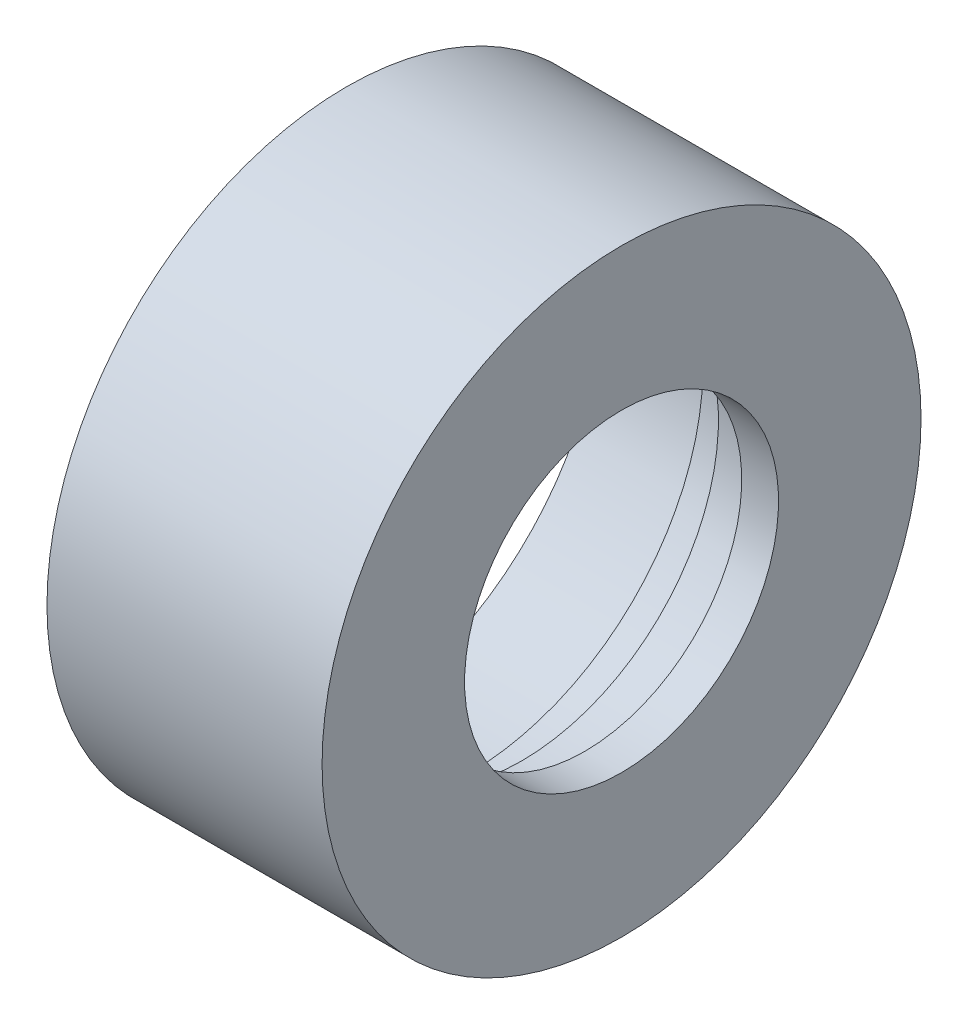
ISO-10303-21;
HEADER;
FILE_DESCRIPTION(('STEP AP214'),'2;1');
FILE_NAME('part.step','',(''),(''),'','','');
FILE_SCHEMA(('AUTOMOTIVE_DESIGN { 1 0 10303 214 1 1 1 1 }'));
ENDSEC;
DATA;
#1=APPLICATION_CONTEXT('core data for automotive mechanical design processes');
#2=APPLICATION_PROTOCOL_DEFINITION('international standard','automotive_design',2000,#1);
#3=PRODUCT_CONTEXT('',#1,'mechanical');
#4=PRODUCT('Part','Part','',(#3));
#5=PRODUCT_RELATED_PRODUCT_CATEGORY('part','',(#4));
#6=PRODUCT_DEFINITION_FORMATION('','',#4);
#7=PRODUCT_DEFINITION_CONTEXT('part definition',#1,'design');
#8=PRODUCT_DEFINITION('design','',#6,#7);
#9=PRODUCT_DEFINITION_SHAPE('','',#8);
#10=(LENGTH_UNIT() NAMED_UNIT(*) SI_UNIT(.MILLI.,.METRE.));
#11=(NAMED_UNIT(*) PLANE_ANGLE_UNIT() SI_UNIT($,.RADIAN.));
#12=(NAMED_UNIT(*) SI_UNIT($,.STERADIAN.) SOLID_ANGLE_UNIT());
#13=UNCERTAINTY_MEASURE_WITH_UNIT(LENGTH_MEASURE(1.E-05),#10,'distance_accuracy_value','');
#14=(GEOMETRIC_REPRESENTATION_CONTEXT(3) GLOBAL_UNCERTAINTY_ASSIGNED_CONTEXT((#13)) GLOBAL_UNIT_ASSIGNED_CONTEXT((#10,
#11,#12)) REPRESENTATION_CONTEXT('',''));
#15=CARTESIAN_POINT('',(0.,0.,0.));
#16=DIRECTION('',(0.,0.,1.));
#17=DIRECTION('',(1.,0.,0.));
#18=AXIS2_PLACEMENT_3D('',#15,#16,#17);
#19=CARTESIAN_POINT('',(-44.5563865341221,85.6586404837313,0.));
#20=DIRECTION('',(-1.,0.,0.));
#21=DIRECTION('',(0.,-1.,0.));
#22=AXIS2_PLACEMENT_3D('',#19,#20,#21);
#23=CYLINDRICAL_SURFACE('',#22,25.025);
#24=CARTESIAN_POINT('',(-23.9795898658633,85.6586404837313,0.));
#25=DIRECTION('',(-1.,0.,0.));
#26=DIRECTION('',(0.,-1.,0.));
#27=AXIS2_PLACEMENT_3D('',#24,#25,#26);
#28=CIRCLE('',#27,25.025);
#29=CARTESIAN_POINT('',(-23.9795898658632,60.6336404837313,0.));
#30=VERTEX_POINT('',#29);
#31=EDGE_CURVE('E62',#30,#30,#28,.T.);
#32=ORIENTED_EDGE('',*,*,#31,.T.);
#33=EDGE_LOOP('',(#32));
#34=FACE_BOUND('',#33,.T.);
#35=CARTESIAN_POINT('',(-15.9886874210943,85.6586404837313,0.));
#36=DIRECTION('',(-1.,0.,0.));
#37=DIRECTION('',(0.,-1.,0.));
#38=AXIS2_PLACEMENT_3D('',#35,#36,#37);
#39=CIRCLE('',#38,25.025);
#40=CARTESIAN_POINT('',(-15.9886874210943,60.6336404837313,0.));
#41=VERTEX_POINT('',#40);
#42=EDGE_CURVE('E10',#41,#41,#39,.T.);
#43=ORIENTED_EDGE('',*,*,#42,.F.);
#44=EDGE_LOOP('',(#43));
#45=FACE_BOUND('',#44,.T.);
#46=ADVANCED_FACE('F28',(#34,#45),#23,.F.);
#47=CARTESIAN_POINT('',(-15.9886874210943,85.6586404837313,0.));
#48=DIRECTION('',(-1.,0.,0.));
#49=DIRECTION('',(0.,-1.,0.));
#50=AXIS2_PLACEMENT_3D('',#47,#48,#49);
#51=CONICAL_SURFACE('',#50,25.025,1.56584893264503);
#52=CARTESIAN_POINT('',(-15.9636874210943,85.6586404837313,0.));
#53=DIRECTION('',(-1.,0.,0.));
#54=DIRECTION('',(0.,-1.,0.));
#55=AXIS2_PLACEMENT_3D('',#52,#53,#54);
#56=CIRCLE('',#55,19.9718760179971);
#57=CARTESIAN_POINT('',(-15.9636874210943,65.6867644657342,0.));
#58=VERTEX_POINT('',#57);
#59=EDGE_CURVE('E34',#58,#58,#56,.T.);
#60=ORIENTED_EDGE('',*,*,#59,.F.);
#61=EDGE_LOOP('',(#60));
#62=FACE_BOUND('',#61,.T.);
#63=ORIENTED_EDGE('',*,*,#42,.T.);
#64=EDGE_LOOP('',(#63));
#65=FACE_BOUND('',#64,.T.);
#66=ADVANCED_FACE('F112',(#62,#65),#51,.F.);
#67=CARTESIAN_POINT('',(-44.5563865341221,85.6586404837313,0.));
#68=DIRECTION('',(-1.,0.,0.));
#69=DIRECTION('',(0.,-1.,0.));
#70=AXIS2_PLACEMENT_3D('',#67,#68,#69);
#71=CYLINDRICAL_SURFACE('',#70,19.9718760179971);
#72=CARTESIAN_POINT('',(-11.2795898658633,85.6586404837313,0.));
#73=DIRECTION('',(-1.,0.,0.));
#74=DIRECTION('',(0.,-1.,0.));
#75=AXIS2_PLACEMENT_3D('',#72,#73,#74);
#76=CIRCLE('',#75,19.9718760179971);
#77=CARTESIAN_POINT('',(-11.2795898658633,65.6867644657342,0.));
#78=VERTEX_POINT('',#77);
#79=EDGE_CURVE('E38',#78,#78,#76,.T.);
#80=ORIENTED_EDGE('',*,*,#79,.F.);
#81=EDGE_LOOP('',(#80));
#82=FACE_BOUND('',#81,.T.);
#83=ORIENTED_EDGE('',*,*,#59,.T.);
#84=EDGE_LOOP('',(#83));
#85=FACE_BOUND('',#84,.T.);
#86=ADVANCED_FACE('F107',(#82,#85),#71,.F.);
#87=CARTESIAN_POINT('',(-11.2795898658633,80.2400197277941,0.));
#88=DIRECTION('',(-1.,0.,0.));
#89=DIRECTION('',(0.,-1.,0.));
#90=AXIS2_PLACEMENT_3D('',#87,#88,#89);
#91=PLANE('',#90);
#92=CARTESIAN_POINT('',(-11.2795898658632,85.6586404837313,0.));
#93=DIRECTION('',(-1.,0.,0.));
#94=DIRECTION('',(0.,-1.,0.));
#95=AXIS2_PLACEMENT_3D('',#92,#93,#94);
#96=CIRCLE('',#95,38.1);
#97=CARTESIAN_POINT('',(-11.2795898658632,47.5586404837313,0.));
#98=VERTEX_POINT('',#97);
#99=EDGE_CURVE('E42',#98,#98,#96,.T.);
#100=ORIENTED_EDGE('',*,*,#99,.F.);
#101=EDGE_LOOP('',(#100));
#102=FACE_BOUND('',#101,.T.);
#103=ORIENTED_EDGE('',*,*,#79,.T.);
#104=EDGE_LOOP('',(#103));
#105=FACE_BOUND('',#104,.T.);
#106=ADVANCED_FACE('F101',(#102,#105),#91,.F.);
#107=CARTESIAN_POINT('',(-44.5563865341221,85.6586404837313,0.));
#108=DIRECTION('',(-1.,0.,0.));
#109=DIRECTION('',(0.,-1.,0.));
#110=AXIS2_PLACEMENT_3D('',#107,#108,#109);
#111=CYLINDRICAL_SURFACE('',#110,38.1);
#112=CARTESIAN_POINT('',(-46.2795898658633,85.6586404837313,0.));
#113=DIRECTION('',(-1.,0.,0.));
#114=DIRECTION('',(0.,-1.,0.));
#115=AXIS2_PLACEMENT_3D('',#112,#113,#114);
#116=CIRCLE('',#115,38.1);
#117=CARTESIAN_POINT('',(-46.2795898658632,47.5586404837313,0.));
#118=VERTEX_POINT('',#117);
#119=EDGE_CURVE('E47',#118,#118,#116,.T.);
#120=ORIENTED_EDGE('',*,*,#119,.F.);
#121=EDGE_LOOP('',(#120));
#122=FACE_BOUND('',#121,.T.);
#123=ORIENTED_EDGE('',*,*,#99,.T.);
#124=EDGE_LOOP('',(#123));
#125=FACE_BOUND('',#124,.T.);
#126=ADVANCED_FACE('F95',(#122,#125),#111,.T.);
#127=CARTESIAN_POINT('',(-46.2795898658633,80.2400197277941,0.));
#128=DIRECTION('',(1.,0.,0.));
#129=DIRECTION('',(0.,1.,0.));
#130=AXIS2_PLACEMENT_3D('',#127,#128,#129);
#131=PLANE('',#130);
#132=CARTESIAN_POINT('',(-46.2795898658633,85.6586404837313,0.));
#133=DIRECTION('',(-1.,0.,0.));
#134=DIRECTION('',(0.,-1.,0.));
#135=AXIS2_PLACEMENT_3D('',#132,#133,#134);
#136=CIRCLE('',#135,32.6211655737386);
#137=CARTESIAN_POINT('',(-46.2795898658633,53.0374749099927,0.));
#138=VERTEX_POINT('',#137);
#139=EDGE_CURVE('E50',#138,#138,#136,.T.);
#140=ORIENTED_EDGE('',*,*,#139,.F.);
#141=EDGE_LOOP('',(#140));
#142=FACE_BOUND('',#141,.T.);
#143=ORIENTED_EDGE('',*,*,#119,.T.);
#144=EDGE_LOOP('',(#143));
#145=FACE_BOUND('',#144,.T.);
#146=ADVANCED_FACE('F89',(#142,#145),#131,.F.);
#147=CARTESIAN_POINT('',(-44.5563865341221,85.6586404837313,0.));
#148=DIRECTION('',(-1.,0.,0.));
#149=DIRECTION('',(0.,-1.,0.));
#150=AXIS2_PLACEMENT_3D('',#147,#148,#149);
#151=CYLINDRICAL_SURFACE('',#150,32.6211655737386);
#152=CARTESIAN_POINT('',(-30.7795898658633,85.6586404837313,0.));
#153=DIRECTION('',(-1.,0.,0.));
#154=DIRECTION('',(0.,-1.,0.));
#155=AXIS2_PLACEMENT_3D('',#152,#153,#154);
#156=CIRCLE('',#155,32.6211655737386);
#157=CARTESIAN_POINT('',(-30.7795898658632,53.0374749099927,0.));
#158=VERTEX_POINT('',#157);
#159=EDGE_CURVE('E53',#158,#158,#156,.T.);
#160=ORIENTED_EDGE('',*,*,#159,.F.);
#161=EDGE_LOOP('',(#160));
#162=FACE_BOUND('',#161,.T.);
#163=ORIENTED_EDGE('',*,*,#139,.T.);
#164=EDGE_LOOP('',(#163));
#165=FACE_BOUND('',#164,.T.);
#166=ADVANCED_FACE('F83',(#162,#165),#151,.F.);
#167=CARTESIAN_POINT('',(-30.7795898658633,80.2400197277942,0.));
#168=DIRECTION('',(1.,0.,0.));
#169=DIRECTION('',(0.,1.,0.));
#170=AXIS2_PLACEMENT_3D('',#167,#168,#169);
#171=PLANE('',#170);
#172=CARTESIAN_POINT('',(-30.7795898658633,85.6586404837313,0.));
#173=DIRECTION('',(-1.,0.,0.));
#174=DIRECTION('',(0.,-1.,0.));
#175=AXIS2_PLACEMENT_3D('',#172,#173,#174);
#176=CIRCLE('',#175,29.8508758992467);
#177=CARTESIAN_POINT('',(-30.7795898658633,55.8077645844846,0.));
#178=VERTEX_POINT('',#177);
#179=EDGE_CURVE('E56',#178,#178,#176,.T.);
#180=ORIENTED_EDGE('',*,*,#179,.F.);
#181=EDGE_LOOP('',(#180));
#182=FACE_BOUND('',#181,.T.);
#183=ORIENTED_EDGE('',*,*,#159,.T.);
#184=EDGE_LOOP('',(#183));
#185=FACE_BOUND('',#184,.T.);
#186=ADVANCED_FACE('F77',(#182,#185),#171,.F.);
#187=CARTESIAN_POINT('',(-44.5563865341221,85.6586404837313,0.));
#188=DIRECTION('',(-1.,0.,0.));
#189=DIRECTION('',(0.,-1.,0.));
#190=AXIS2_PLACEMENT_3D('',#187,#188,#189);
#191=CYLINDRICAL_SURFACE('',#190,29.8508758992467);
#192=CARTESIAN_POINT('',(-23.9795898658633,85.6586404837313,0.));
#193=DIRECTION('',(-1.,0.,0.));
#194=DIRECTION('',(0.,-1.,0.));
#195=AXIS2_PLACEMENT_3D('',#192,#193,#194);
#196=CIRCLE('',#195,29.8508758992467);
#197=CARTESIAN_POINT('',(-23.9795898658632,55.8077645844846,0.));
#198=VERTEX_POINT('',#197);
#199=EDGE_CURVE('E59',#198,#198,#196,.T.);
#200=ORIENTED_EDGE('',*,*,#199,.F.);
#201=EDGE_LOOP('',(#200));
#202=FACE_BOUND('',#201,.T.);
#203=ORIENTED_EDGE('',*,*,#179,.T.);
#204=EDGE_LOOP('',(#203));
#205=FACE_BOUND('',#204,.T.);
#206=ADVANCED_FACE('F71',(#202,#205),#191,.F.);
#207=CARTESIAN_POINT('',(-23.9795898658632,80.2400197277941,0.));
#208=DIRECTION('',(1.,0.,0.));
#209=DIRECTION('',(0.,1.,0.));
#210=AXIS2_PLACEMENT_3D('',#207,#208,#209);
#211=PLANE('',#210);
#212=ORIENTED_EDGE('',*,*,#31,.F.);
#213=EDGE_LOOP('',(#212));
#214=FACE_BOUND('',#213,.T.);
#215=ORIENTED_EDGE('',*,*,#199,.T.);
#216=EDGE_LOOP('',(#215));
#217=FACE_BOUND('',#216,.T.);
#218=ADVANCED_FACE('F68',(#214,#217),#211,.F.);
#219=CLOSED_SHELL('',(#46,#66,#86,#106,#126,#146,#166,#186,#206,#218));
#220=MANIFOLD_SOLID_BREP('B2',#219);
#221=ADVANCED_BREP_SHAPE_REPRESENTATION('',(#18,#220),#14);
#222=SHAPE_DEFINITION_REPRESENTATION(#9,#221);
ENDSEC;
END-ISO-10303-21;
